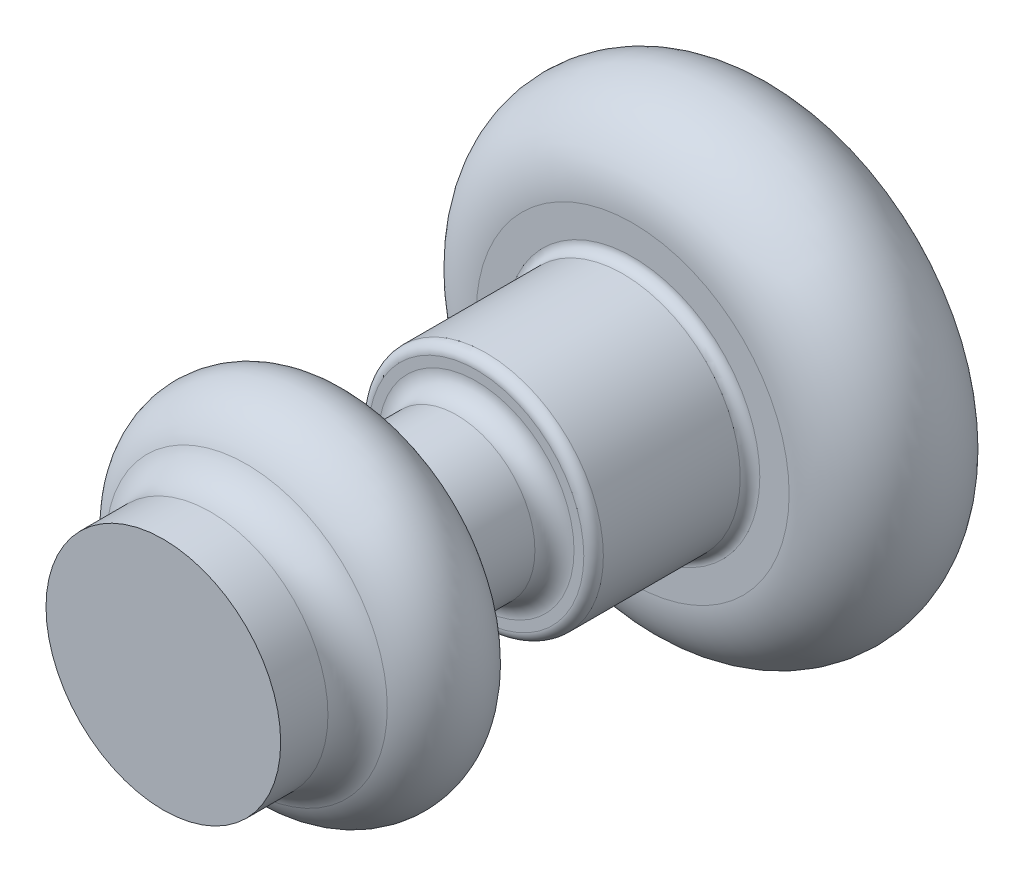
from build123d import *


with BuildPart() as part:
    # Sketch1 → Revolve1 (revolve)
    with BuildSketch(Plane(origin=(0, 0, 0), x_dir=(1, 0, 0), z_dir=(0, 1, 0)), mode=Mode.PRIVATE) as revolve1_sk:
        with BuildLine():
            ThreePointArc((-30.6, 2.55), (-29.853122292, 0.746877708), (-28.05, 0))
            Line((-28.05, 0), (-25.5, 0))
            ThreePointArc((-25.5, 0), (-21.893755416, -1.493755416), (-20.4, -5.1))
            Line((-20.4, -5.1), (-20.4, -20.4))
            ThreePointArc((-20.4, -20.4), (-23.387510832, -27.612489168), (-30.6, -30.6))
            ThreePointArc((-30.6, -30.6), (-45.577266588, -42.774062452), (-36.72, -59.922681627))
            ThreePointArc((-36.72, -59.922681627), (-32.266067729, -63.684365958), (-30.6, -69.271136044))
            Line((-30.6, -69.271136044), (-30.6, -81.6))
            Line((-30.6, -81.6), (0, -81.6))
            Line((0, -81.6), (0, 81.6))
            Line((0, 81.6), (-40.8, 81.6))
            ThreePointArc((-40.8, 81.6), (-61.2, 61.2), (-40.8, 40.8))
            Line((-40.8, 40.8), (-33.15, 40.8))
            ThreePointArc((-33.15, 40.8), (-31.346877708, 40.053122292), (-30.6, 38.25))
            Line((-30.6, 38.25), (-30.6, 2.55))
        make_face()
    revolve(revolve1_sk.sketch.rotate(Axis((0, 0, 81.6), (0, 0, -1)), 180), axis=Axis((0, 0, 81.6), (0, 0, -1)))


solid = part.part
